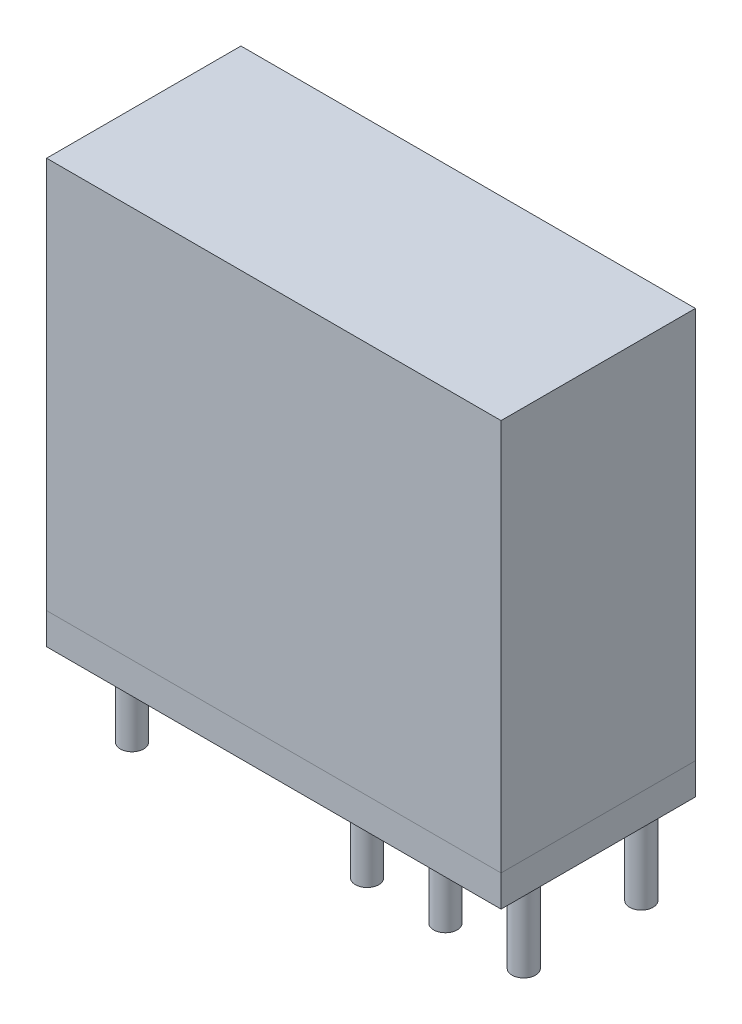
from build123d import *

# Parameters (mm, degrees)
ESQUISSE1_W        = 29
ESQUISSE1_H        = 12.4
BOSS_EXTRU_1_DEPTH = 2
ESQUISSE3_W        = 29.000480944
ESQUISSE3_H        = 12.400412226
BOSS_EXTRU_3_DEPTH = 25
ESQUISSE4_R        = 0.75
BOSS_EXTRU_4_DEPTH = 5


with BuildPart() as part:
    # Esquisse1 → Boss.-Extru.1 (new body)
    with BuildSketch(Plane(origin=(0, 0, 0), x_dir=(1, 0, 0), z_dir=(0, 1, 0))):
        with Locations((14.5, 6.2)):
            Rectangle(ESQUISSE1_W, ESQUISSE1_H)
    extrude(amount=BOSS_EXTRU_1_DEPTH)

    # Esquisse3 → Boss.-Extru.3 (add)
    with BuildSketch(Plane(origin=(0, 2, 0), x_dir=(1, 0, 0), z_dir=(0, 1, 0))):
        with Locations((14.5, 6.2)):
            Rectangle(ESQUISSE3_W, ESQUISSE3_H)
    extrude(amount=BOSS_EXTRU_3_DEPTH)

    # Esquisse4 → Boss.-Extru.4 (add)
    with BuildSketch(Plane.XZ):
        with Locations(Location((28, -2.45, 0), (0, 0, 90))):
            Circle(ESQUISSE4_R)
        with Locations(Location((23, -2.45, 0), (0, 0, 90))):
            Circle(ESQUISSE4_R)
        with Locations(Location((18, -2.45, 0), (0, 0, 90))):
            Circle(ESQUISSE4_R)
        with Locations(Location((3, -2.45, 0), (0, 0, 90))):
            Circle(ESQUISSE4_R)
        with Locations(Location((28, -9.95, 0), (0, 0, 90))):
            Circle(ESQUISSE4_R)
        with Locations(Location((23, -9.95, 0), (0, 0, 90))):
            Circle(ESQUISSE4_R)
        with Locations(Location((18, -9.95, 0), (0, 0, 90))):
            Circle(ESQUISSE4_R)
        with Locations(Location((3, -9.95, 0), (0, 0, 90))):
            Circle(ESQUISSE4_R)
    extrude(amount=BOSS_EXTRU_4_DEPTH)


solid = part.part
